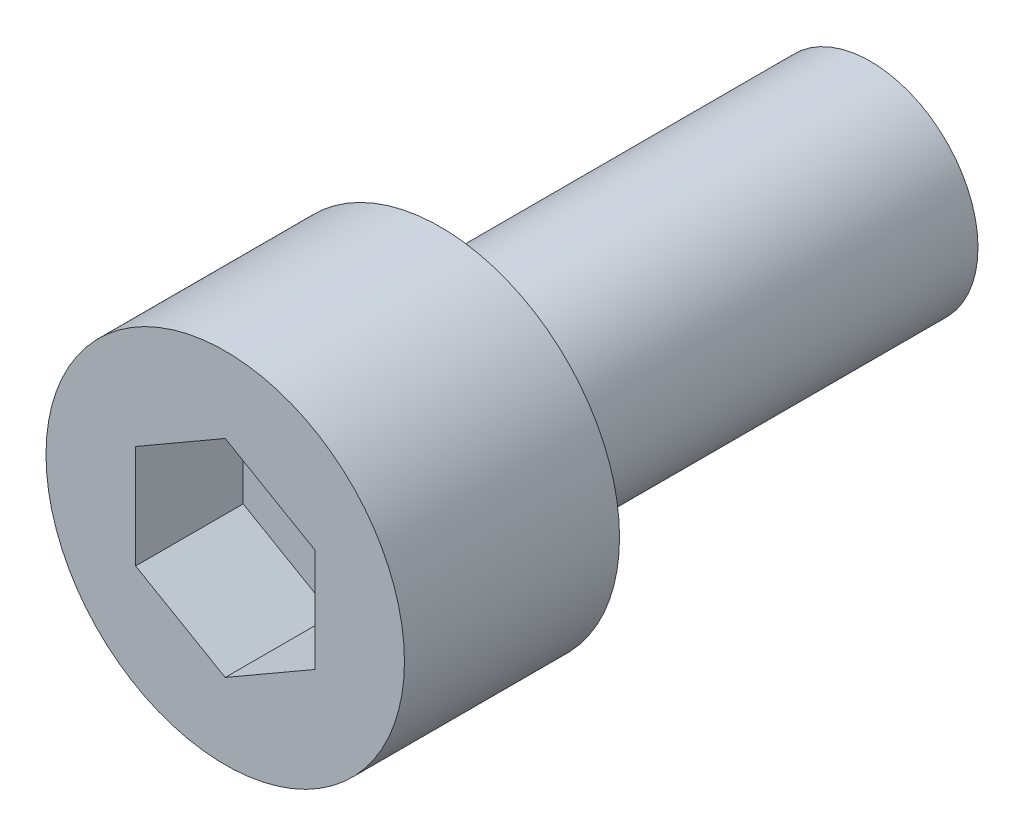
ISO-10303-21;
HEADER;
FILE_DESCRIPTION(('STEP AP214'),'2;1');
FILE_NAME('part.step','',(''),(''),'','','');
FILE_SCHEMA(('AUTOMOTIVE_DESIGN { 1 0 10303 214 1 1 1 1 }'));
ENDSEC;
DATA;
#1=APPLICATION_CONTEXT('core data for automotive mechanical design processes');
#2=APPLICATION_PROTOCOL_DEFINITION('international standard','automotive_design',2000,#1);
#3=PRODUCT_CONTEXT('',#1,'mechanical');
#4=PRODUCT('Part','Part','',(#3));
#5=PRODUCT_RELATED_PRODUCT_CATEGORY('part','',(#4));
#6=PRODUCT_DEFINITION_FORMATION('','',#4);
#7=PRODUCT_DEFINITION_CONTEXT('part definition',#1,'design');
#8=PRODUCT_DEFINITION('design','',#6,#7);
#9=PRODUCT_DEFINITION_SHAPE('','',#8);
#10=(LENGTH_UNIT() NAMED_UNIT(*) SI_UNIT(.MILLI.,.METRE.));
#11=(NAMED_UNIT(*) PLANE_ANGLE_UNIT() SI_UNIT($,.RADIAN.));
#12=(NAMED_UNIT(*) SI_UNIT($,.STERADIAN.) SOLID_ANGLE_UNIT());
#13=UNCERTAINTY_MEASURE_WITH_UNIT(LENGTH_MEASURE(1.E-05),#10,'distance_accuracy_value','');
#14=(GEOMETRIC_REPRESENTATION_CONTEXT(3) GLOBAL_UNCERTAINTY_ASSIGNED_CONTEXT((#13)) GLOBAL_UNIT_ASSIGNED_CONTEXT((#10,
#11,#12)) REPRESENTATION_CONTEXT('',''));
#15=CARTESIAN_POINT('',(0.,0.,0.));
#16=DIRECTION('',(0.,0.,1.));
#17=DIRECTION('',(1.,0.,0.));
#18=AXIS2_PLACEMENT_3D('',#15,#16,#17);
#19=CARTESIAN_POINT('',(3.,0.,-12.));
#20=DIRECTION('',(0.,0.,-1.));
#21=DIRECTION('',(-1.,0.,0.));
#22=AXIS2_PLACEMENT_3D('',#19,#20,#21);
#23=PLANE('',#22);
#24=CARTESIAN_POINT('',(0.,0.,-12.));
#25=DIRECTION('',(0.,0.,-1.));
#26=DIRECTION('',(-1.,0.,0.));
#27=AXIS2_PLACEMENT_3D('',#24,#25,#26);
#28=CIRCLE('',#27,3.);
#29=CARTESIAN_POINT('',(-3.,0.,-12.));
#30=VERTEX_POINT('',#29);
#31=EDGE_CURVE('E11',#30,#30,#28,.T.);
#32=ORIENTED_EDGE('',*,*,#31,.T.);
#33=EDGE_LOOP('',(#32));
#34=FACE_BOUND('',#33,.T.);
#35=ADVANCED_FACE('F17',(#34),#23,.T.);
#36=CARTESIAN_POINT('',(0.,2.88675134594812,3.));
#37=DIRECTION('',(-0.5,-0.86602540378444,0.));
#38=DIRECTION('',(0.86602540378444,-0.5,0.));
#39=AXIS2_PLACEMENT_3D('',#36,#37,#38);
#40=PLANE('',#39);
#41=DIRECTION('',(0.,0.,1.));
#42=VECTOR('',#41,1.);
#43=CARTESIAN_POINT('',(2.5,1.44337567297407,3.));
#44=LINE('',#43,#42);
#45=CARTESIAN_POINT('',(2.5,1.44337567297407,3.));
#46=VERTEX_POINT('',#45);
#47=CARTESIAN_POINT('',(2.5,1.44337567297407,6.));
#48=VERTEX_POINT('',#47);
#49=EDGE_CURVE('E66',#46,#48,#44,.T.);
#50=ORIENTED_EDGE('',*,*,#49,.T.);
#51=DIRECTION('',(0.86602540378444,-0.5,0.));
#52=VECTOR('',#51,1.);
#53=CARTESIAN_POINT('',(0.,2.88675134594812,6.));
#54=LINE('',#53,#52);
#55=CARTESIAN_POINT('',(0.,2.88675134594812,6.));
#56=VERTEX_POINT('',#55);
#57=EDGE_CURVE('E32',#56,#48,#54,.T.);
#58=ORIENTED_EDGE('',*,*,#57,.F.);
#59=DIRECTION('',(0.,0.,1.));
#60=VECTOR('',#59,1.);
#61=CARTESIAN_POINT('',(0.,2.88675134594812,3.));
#62=LINE('',#61,#60);
#63=CARTESIAN_POINT('',(0.,2.88675134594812,3.));
#64=VERTEX_POINT('',#63);
#65=EDGE_CURVE('E36',#64,#56,#62,.T.);
#66=ORIENTED_EDGE('',*,*,#65,.F.);
#67=DIRECTION('',(0.86602540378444,-0.5,0.));
#68=VECTOR('',#67,1.);
#69=CARTESIAN_POINT('',(0.,2.88675134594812,3.));
#70=LINE('',#69,#68);
#71=EDGE_CURVE('E69',#64,#46,#70,.T.);
#72=ORIENTED_EDGE('',*,*,#71,.T.);
#73=EDGE_LOOP('',(#50,#58,#66,#72));
#74=FACE_BOUND('',#73,.T.);
#75=ADVANCED_FACE('F68',(#74),#40,.T.);
#76=CARTESIAN_POINT('',(2.5,-1.44337567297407,3.));
#77=DIRECTION('',(1.,0.,0.));
#78=DIRECTION('',(0.,1.,0.));
#79=AXIS2_PLACEMENT_3D('',#76,#77,#78);
#80=PLANE('',#79);
#81=DIRECTION('',(0.,0.,1.));
#82=VECTOR('',#81,1.);
#83=CARTESIAN_POINT('',(2.5,-1.44337567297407,3.));
#84=LINE('',#83,#82);
#85=CARTESIAN_POINT('',(2.5,-1.44337567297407,3.));
#86=VERTEX_POINT('',#85);
#87=CARTESIAN_POINT('',(2.5,-1.44337567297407,6.));
#88=VERTEX_POINT('',#87);
#89=EDGE_CURVE('E74',#86,#88,#84,.T.);
#90=ORIENTED_EDGE('',*,*,#89,.T.);
#91=DIRECTION('',(0.,1.,0.));
#92=VECTOR('',#91,1.);
#93=CARTESIAN_POINT('',(2.5,-1.44337567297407,6.));
#94=LINE('',#93,#92);
#95=EDGE_CURVE('E77',#88,#48,#94,.T.);
#96=ORIENTED_EDGE('',*,*,#95,.T.);
#97=ORIENTED_EDGE('',*,*,#49,.F.);
#98=DIRECTION('',(0.,1.,0.));
#99=VECTOR('',#98,1.);
#100=CARTESIAN_POINT('',(2.5,-1.44337567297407,3.));
#101=LINE('',#100,#99);
#102=EDGE_CURVE('E104',#86,#46,#101,.T.);
#103=ORIENTED_EDGE('',*,*,#102,.F.);
#104=EDGE_LOOP('',(#90,#96,#97,#103));
#105=FACE_BOUND('',#104,.T.);
#106=ADVANCED_FACE('F78',(#105),#80,.F.);
#107=CARTESIAN_POINT('',(0.,-2.88675134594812,3.));
#108=DIRECTION('',(0.5,-0.86602540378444,0.));
#109=DIRECTION('',(0.86602540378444,0.5,0.));
#110=AXIS2_PLACEMENT_3D('',#107,#108,#109);
#111=PLANE('',#110);
#112=DIRECTION('',(0.,0.,1.));
#113=VECTOR('',#112,1.);
#114=CARTESIAN_POINT('',(0.,-2.88675134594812,3.));
#115=LINE('',#114,#113);
#116=CARTESIAN_POINT('',(0.,-2.88675134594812,3.));
#117=VERTEX_POINT('',#116);
#118=CARTESIAN_POINT('',(0.,-2.88675134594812,6.));
#119=VERTEX_POINT('',#118);
#120=EDGE_CURVE('E112',#117,#119,#115,.T.);
#121=ORIENTED_EDGE('',*,*,#120,.T.);
#122=DIRECTION('',(0.86602540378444,0.5,0.));
#123=VECTOR('',#122,1.);
#124=CARTESIAN_POINT('',(0.,-2.88675134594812,6.));
#125=LINE('',#124,#123);
#126=EDGE_CURVE('E82',#119,#88,#125,.T.);
#127=ORIENTED_EDGE('',*,*,#126,.T.);
#128=ORIENTED_EDGE('',*,*,#89,.F.);
#129=DIRECTION('',(0.86602540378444,0.5,0.));
#130=VECTOR('',#129,1.);
#131=CARTESIAN_POINT('',(0.,-2.88675134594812,3.));
#132=LINE('',#131,#130);
#133=EDGE_CURVE('E101',#117,#86,#132,.T.);
#134=ORIENTED_EDGE('',*,*,#133,.F.);
#135=EDGE_LOOP('',(#121,#127,#128,#134));
#136=FACE_BOUND('',#135,.T.);
#137=ADVANCED_FACE('F213',(#136),#111,.F.);
#138=CARTESIAN_POINT('',(0.,-2.88675134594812,3.));
#139=DIRECTION('',(0.5,0.86602540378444,0.));
#140=DIRECTION('',(-0.86602540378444,0.5,0.));
#141=AXIS2_PLACEMENT_3D('',#138,#139,#140);
#142=PLANE('',#141);
#143=DIRECTION('',(0.,0.,1.));
#144=VECTOR('',#143,1.);
#145=CARTESIAN_POINT('',(-2.5,-1.44337567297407,3.));
#146=LINE('',#145,#144);
#147=CARTESIAN_POINT('',(-2.5,-1.44337567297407,3.));
#148=VERTEX_POINT('',#147);
#149=CARTESIAN_POINT('',(-2.5,-1.44337567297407,6.));
#150=VERTEX_POINT('',#149);
#151=EDGE_CURVE('E110',#148,#150,#146,.T.);
#152=ORIENTED_EDGE('',*,*,#151,.T.);
#153=DIRECTION('',(-0.86602540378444,0.5,0.));
#154=VECTOR('',#153,1.);
#155=CARTESIAN_POINT('',(0.,-2.88675134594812,6.));
#156=LINE('',#155,#154);
#157=EDGE_CURVE('E250',#119,#150,#156,.T.);
#158=ORIENTED_EDGE('',*,*,#157,.F.);
#159=ORIENTED_EDGE('',*,*,#120,.F.);
#160=DIRECTION('',(-0.86602540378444,0.5,0.));
#161=VECTOR('',#160,1.);
#162=CARTESIAN_POINT('',(0.,-2.88675134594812,3.));
#163=LINE('',#162,#161);
#164=EDGE_CURVE('E98',#117,#148,#163,.T.);
#165=ORIENTED_EDGE('',*,*,#164,.T.);
#166=EDGE_LOOP('',(#152,#158,#159,#165));
#167=FACE_BOUND('',#166,.T.);
#168=ADVANCED_FACE('F203',(#167),#142,.T.);
#169=CARTESIAN_POINT('',(-2.5,1.44337567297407,3.));
#170=DIRECTION('',(-1.,0.,0.));
#171=DIRECTION('',(0.,-1.,0.));
#172=AXIS2_PLACEMENT_3D('',#169,#170,#171);
#173=PLANE('',#172);
#174=DIRECTION('',(0.,0.,1.));
#175=VECTOR('',#174,1.);
#176=CARTESIAN_POINT('',(-2.5,1.44337567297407,3.));
#177=LINE('',#176,#175);
#178=CARTESIAN_POINT('',(-2.5,1.44337567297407,3.));
#179=VERTEX_POINT('',#178);
#180=CARTESIAN_POINT('',(-2.5,1.44337567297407,6.));
#181=VERTEX_POINT('',#180);
#182=EDGE_CURVE('E108',#179,#181,#177,.T.);
#183=ORIENTED_EDGE('',*,*,#182,.T.);
#184=DIRECTION('',(0.,-1.,0.));
#185=VECTOR('',#184,1.);
#186=CARTESIAN_POINT('',(-2.5,1.44337567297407,6.));
#187=LINE('',#186,#185);
#188=EDGE_CURVE('E252',#181,#150,#187,.T.);
#189=ORIENTED_EDGE('',*,*,#188,.T.);
#190=ORIENTED_EDGE('',*,*,#151,.F.);
#191=DIRECTION('',(0.,-1.,0.));
#192=VECTOR('',#191,1.);
#193=CARTESIAN_POINT('',(-2.5,1.44337567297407,3.));
#194=LINE('',#193,#192);
#195=EDGE_CURVE('E95',#179,#148,#194,.T.);
#196=ORIENTED_EDGE('',*,*,#195,.F.);
#197=EDGE_LOOP('',(#183,#189,#190,#196));
#198=FACE_BOUND('',#197,.T.);
#199=ADVANCED_FACE('F186',(#198),#173,.F.);
#200=CARTESIAN_POINT('',(0.,2.88675134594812,3.));
#201=DIRECTION('',(-0.5,0.86602540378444,0.));
#202=DIRECTION('',(-0.86602540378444,-0.5,0.));
#203=AXIS2_PLACEMENT_3D('',#200,#201,#202);
#204=PLANE('',#203);
#205=DIRECTION('',(-0.86602540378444,-0.5,0.));
#206=VECTOR('',#205,1.);
#207=CARTESIAN_POINT('',(0.,2.88675134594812,3.));
#208=LINE('',#207,#206);
#209=EDGE_CURVE('E92',#64,#179,#208,.T.);
#210=ORIENTED_EDGE('',*,*,#209,.F.);
#211=ORIENTED_EDGE('',*,*,#65,.T.);
#212=DIRECTION('',(-0.86602540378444,-0.5,0.));
#213=VECTOR('',#212,1.);
#214=CARTESIAN_POINT('',(0.,2.88675134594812,6.));
#215=LINE('',#214,#213);
#216=EDGE_CURVE('E88',#56,#181,#215,.T.);
#217=ORIENTED_EDGE('',*,*,#216,.T.);
#218=ORIENTED_EDGE('',*,*,#182,.F.);
#219=EDGE_LOOP('',(#210,#211,#217,#218));
#220=FACE_BOUND('',#219,.T.);
#221=ADVANCED_FACE('F138',(#220),#204,.F.);
#222=CARTESIAN_POINT('',(2.5,1.44337567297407,3.));
#223=DIRECTION('',(0.,0.,1.));
#224=DIRECTION('',(1.,0.,0.));
#225=AXIS2_PLACEMENT_3D('',#222,#223,#224);
#226=PLANE('',#225);
#227=ORIENTED_EDGE('',*,*,#71,.F.);
#228=ORIENTED_EDGE('',*,*,#209,.T.);
#229=ORIENTED_EDGE('',*,*,#195,.T.);
#230=ORIENTED_EDGE('',*,*,#164,.F.);
#231=ORIENTED_EDGE('',*,*,#133,.T.);
#232=ORIENTED_EDGE('',*,*,#102,.T.);
#233=EDGE_LOOP('',(#227,#228,#229,#230,#231,#232));
#234=FACE_BOUND('',#233,.T.);
#235=ADVANCED_FACE('F136',(#234),#226,.T.);
#236=CARTESIAN_POINT('',(0.,0.,6.));
#237=DIRECTION('',(0.,0.,1.));
#238=DIRECTION('',(1.,0.,0.));
#239=AXIS2_PLACEMENT_3D('',#236,#237,#238);
#240=PLANE('',#239);
#241=CARTESIAN_POINT('',(0.,0.,6.));
#242=DIRECTION('',(0.,0.,1.));
#243=DIRECTION('',(1.,0.,0.));
#244=AXIS2_PLACEMENT_3D('',#241,#242,#243);
#245=CIRCLE('',#244,5.);
#246=CARTESIAN_POINT('',(5.,0.,6.));
#247=VERTEX_POINT('',#246);
#248=EDGE_CURVE('E25',#247,#247,#245,.T.);
#249=ORIENTED_EDGE('',*,*,#248,.T.);
#250=EDGE_LOOP('',(#249));
#251=FACE_BOUND('',#250,.T.);
#252=ORIENTED_EDGE('',*,*,#216,.F.);
#253=ORIENTED_EDGE('',*,*,#57,.T.);
#254=ORIENTED_EDGE('',*,*,#95,.F.);
#255=ORIENTED_EDGE('',*,*,#126,.F.);
#256=ORIENTED_EDGE('',*,*,#157,.T.);
#257=ORIENTED_EDGE('',*,*,#188,.F.);
#258=EDGE_LOOP('',(#252,#253,#254,#255,#256,#257));
#259=FACE_BOUND('',#258,.T.);
#260=ADVANCED_FACE('F85',(#251,#259),#240,.T.);
#261=CARTESIAN_POINT('',(0.,0.,8.));
#262=DIRECTION('',(0.,0.,1.));
#263=DIRECTION('',(1.,0.,0.));
#264=AXIS2_PLACEMENT_3D('',#261,#262,#263);
#265=CYLINDRICAL_SURFACE('',#264,5.);
#266=CARTESIAN_POINT('',(0.,0.,0.));
#267=DIRECTION('',(0.,0.,1.));
#268=DIRECTION('',(1.,0.,0.));
#269=AXIS2_PLACEMENT_3D('',#266,#267,#268);
#270=CIRCLE('',#269,5.);
#271=CARTESIAN_POINT('',(5.,0.,0.));
#272=VERTEX_POINT('',#271);
#273=EDGE_CURVE('E117',#272,#272,#270,.T.);
#274=ORIENTED_EDGE('',*,*,#273,.T.);
#275=EDGE_LOOP('',(#274));
#276=FACE_BOUND('',#275,.T.);
#277=ORIENTED_EDGE('',*,*,#248,.F.);
#278=EDGE_LOOP('',(#277));
#279=FACE_BOUND('',#278,.T.);
#280=ADVANCED_FACE('F123',(#276,#279),#265,.T.);
#281=CARTESIAN_POINT('',(5.,0.,0.));
#282=DIRECTION('',(0.,0.,-1.));
#283=DIRECTION('',(-1.,0.,0.));
#284=AXIS2_PLACEMENT_3D('',#281,#282,#283);
#285=PLANE('',#284);
#286=CARTESIAN_POINT('',(0.,0.,0.));
#287=DIRECTION('',(0.,0.,1.));
#288=DIRECTION('',(1.,0.,0.));
#289=AXIS2_PLACEMENT_3D('',#286,#287,#288);
#290=CIRCLE('',#289,3.);
#291=CARTESIAN_POINT('',(3.,0.,0.));
#292=VERTEX_POINT('',#291);
#293=EDGE_CURVE('E73',#292,#292,#290,.T.);
#294=ORIENTED_EDGE('',*,*,#293,.T.);
#295=EDGE_LOOP('',(#294));
#296=FACE_BOUND('',#295,.T.);
#297=ORIENTED_EDGE('',*,*,#273,.F.);
#298=EDGE_LOOP('',(#297));
#299=FACE_BOUND('',#298,.T.);
#300=ADVANCED_FACE('F125',(#296,#299),#285,.T.);
#301=CARTESIAN_POINT('',(0.,0.,8.));
#302=DIRECTION('',(0.,0.,1.));
#303=DIRECTION('',(1.,0.,0.));
#304=AXIS2_PLACEMENT_3D('',#301,#302,#303);
#305=CYLINDRICAL_SURFACE('',#304,3.);
#306=ORIENTED_EDGE('',*,*,#31,.F.);
#307=EDGE_LOOP('',(#306));
#308=FACE_BOUND('',#307,.T.);
#309=ORIENTED_EDGE('',*,*,#293,.F.);
#310=EDGE_LOOP('',(#309));
#311=FACE_BOUND('',#310,.T.);
#312=ADVANCED_FACE('F19',(#308,#311),#305,.T.);
#313=CLOSED_SHELL('',(#35,#75,#106,#137,#168,#199,#221,#235,#260,#280,#300,#312));
#314=MANIFOLD_SOLID_BREP('B1',#313);
#315=ADVANCED_BREP_SHAPE_REPRESENTATION('',(#18,#314),#14);
#316=SHAPE_DEFINITION_REPRESENTATION(#9,#315);
ENDSEC;
END-ISO-10303-21;
